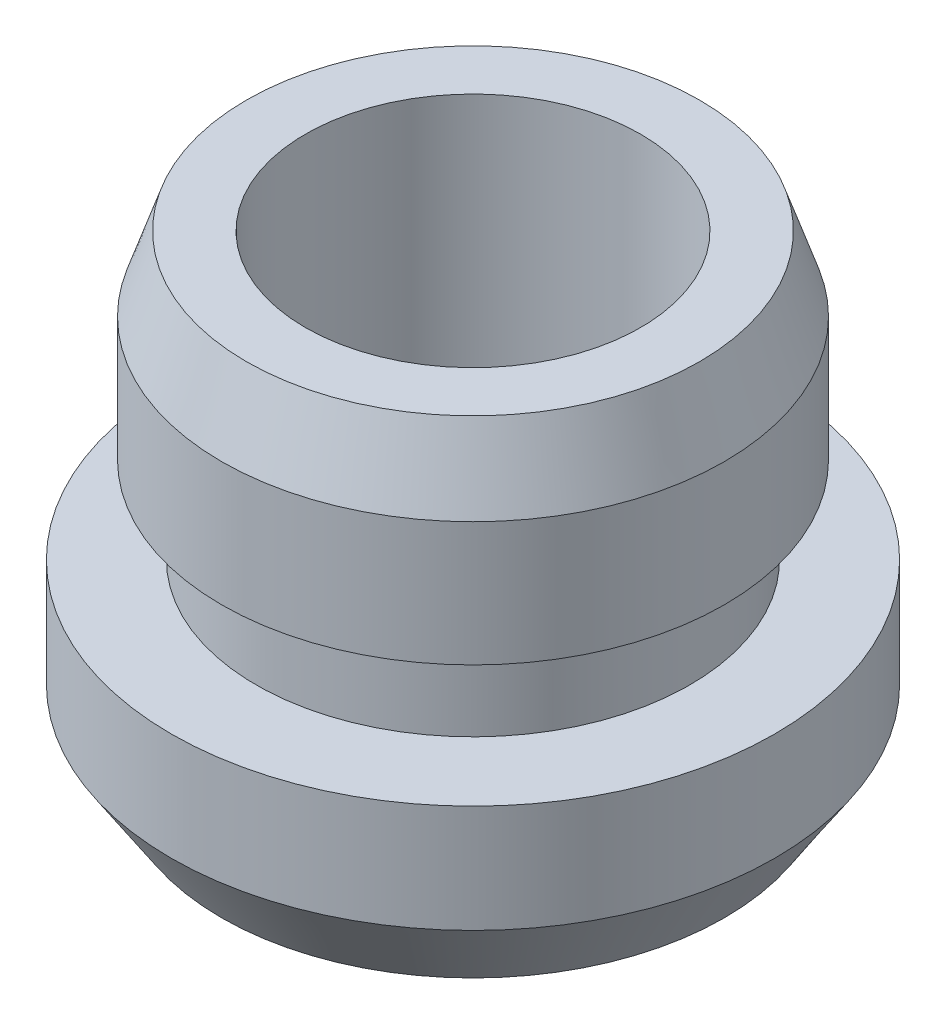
from build123d import *


with BuildPart() as part:
    # Esquisse1 → R_volution1 (revolve)
    with BuildSketch(Plane.XY, mode=Mode.PRIVATE) as r_volution1_sk:
        Polygon((-5, 0), (-7.5, 0), (-9, 2.288578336), (-9, 5.5), (-6.46722847, 5.5), (-6.46722847, 7.452435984), (-7.5, 8.087987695), (-7.5, 11.787504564), (-6.76, 14), (-5, 14), align=None)
    revolve(r_volution1_sk.sketch.rotate(Axis((0, 0, 0), (0, 1, 0)), 270), axis=Axis((0, 0, 0), (0, 1, 0)))


solid = part.part
